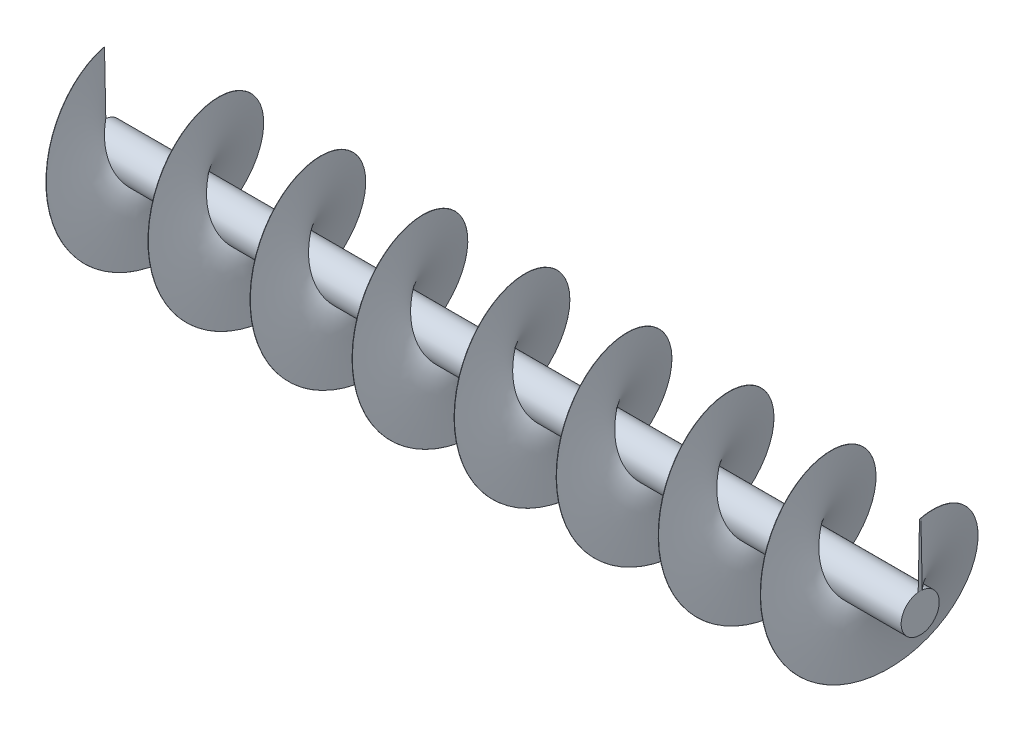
from build123d import *

# Parameters (mm, degrees)
SKETCH1_R           = 10
BOSS_EXTRUDE1_DEPTH = 445
BOSS_EXTRUDE2_START = 1130
SKETCH1_3_R         = 10
BOSS_EXTRUDE2_DEPTH = 1130
BOSS_EXTRUDE3_START = 1130
SKETCH1_4_R         = 35
SKETCH1_4_R_2       = 25
BOSS_EXTRUDE3_DEPTH = 1500
BOSS_EXTRUDE4_START = -360
SKETCH1_5_R         = 25
SKETCH1_5_R_2       = 10
BOSS_EXTRUDE4_DEPTH = 10
BOSS_EXTRUDE5_START = 1130
SKETCH1_6_R         = 25
SKETCH1_6_R_2       = 10
BOSS_EXTRUDE5_DEPTH = 10
SWEEP1_PITCH        = 187.5
SWEEP1_HEIGHT       = 1500
SWEEP1_RADIUS       = 150
SWEEP1_START_ANGLE  = -90


with BuildPart() as part:
    # Sketch1 → Boss-Extrude1 (new body)
    with BuildSketch(Plane(origin=(0, 0, 0), x_dir=(0, 0, -1), z_dir=(1, 0, 0))):
        Circle(SKETCH1_R)
    extrude(amount=-BOSS_EXTRUDE1_DEPTH)

    # Sketch1_3 → Boss-Extrude2 (add)
    with BuildSketch(Plane(origin=(0, 0, 0), x_dir=(0, 0, -1), z_dir=(1, 0, 0)).offset(BOSS_EXTRUDE2_START)):
        Circle(SKETCH1_3_R)
    extrude(amount=-BOSS_EXTRUDE2_DEPTH)



with BuildPart() as body_2:
    # Sketch1_4 → Boss-Extrude3 (new body)
    with BuildSketch(Plane(origin=(0, 0, 0), x_dir=(0, 0, -1), z_dir=(1, 0, 0)).offset(BOSS_EXTRUDE3_START)):
        Circle(SKETCH1_4_R)
        Circle(SKETCH1_4_R_2, mode=Mode.SUBTRACT)
    extrude(amount=-BOSS_EXTRUDE3_DEPTH)


with BuildPart() as part_1:
    add(part.part)

    add(body_2.part)  # Boss-Extrude4 merges body 2
    # Sketch1_5 → Boss-Extrude4 (add)
    with BuildSketch(Plane(origin=(0, 0, 0), x_dir=(0, 0, -1), z_dir=(1, 0, 0)).offset(BOSS_EXTRUDE4_START)):
        Circle(SKETCH1_5_R)
        Circle(SKETCH1_5_R_2, mode=Mode.SUBTRACT)
    extrude(amount=-BOSS_EXTRUDE4_DEPTH)

    # Sketch1_6 → Boss-Extrude5 (add)
    with BuildSketch(Plane(origin=(0, 0, 0), x_dir=(0, 0, -1), z_dir=(1, 0, 0)).offset(BOSS_EXTRUDE5_START)):
        Circle(SKETCH1_6_R)
        Circle(SKETCH1_6_R_2, mode=Mode.SUBTRACT)
    extrude(amount=-BOSS_EXTRUDE5_DEPTH)


with BuildPart() as body_2_2:
    # Sweep1: sweep along a helix
    with BuildLine() as sweep1_path:
        add(Helix(SWEEP1_PITCH, SWEEP1_HEIGHT, SWEEP1_RADIUS, center=(-370, 0, 0), direction=(1, 0, 0), mode=Mode.PRIVATE).rotate(Axis((-370, 0, 0), (1, 0, 0)), SWEEP1_START_ANGLE))
    # Sketch3 → Sweep1 (sweep)
    with BuildSketch(Plane.ZY.offset(370)):
        with BuildLine():
            Line((-1.308980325, 149.99428846), (-3.75, 34.798527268))
            ThreePointArc((-3.75, 34.798527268), (0, 35), (3.75, 34.798527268))
            Line((3.75, 34.798527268), (1.308980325, 149.99428846))
            ThreePointArc((1.308980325, 149.99428846), (0, 150), (-1.308980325, 149.99428846))
        make_face()
    sweep(path=sweep1_path.line, is_frenet=True)


solid = Compound([part_1.part, body_2_2.part])
